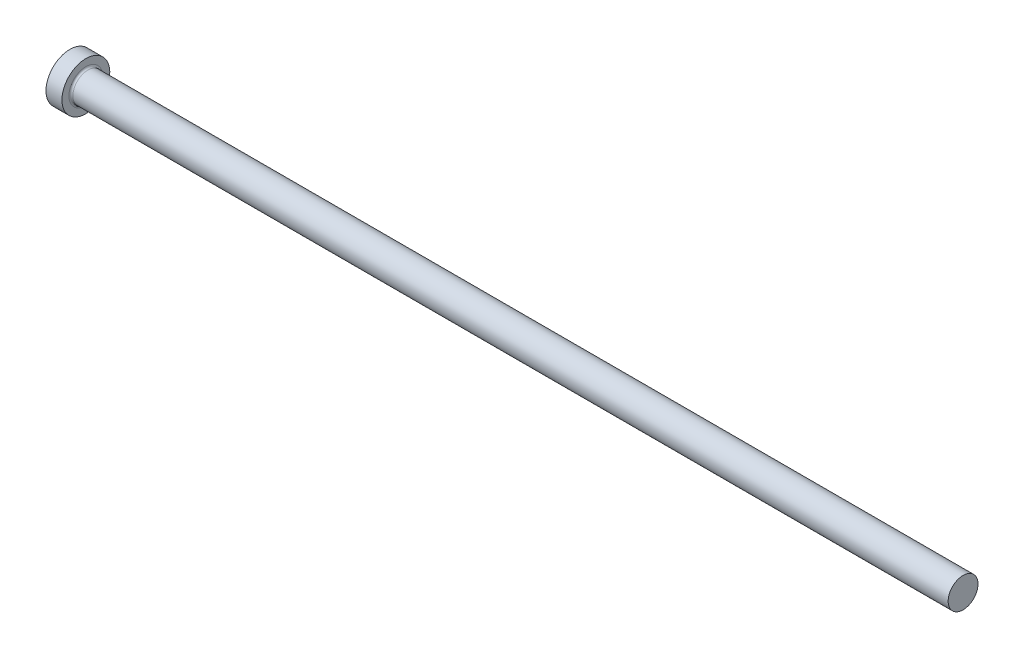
from build123d import *


with BuildPart() as part:
    # Sketch1 → PIN (revolve)
    with BuildSketch(Plane.XY, mode=Mode.PRIVATE) as pin_sk:
        with BuildLine():
            Line((0, 0), (0, 9.525))
            Line((0, 9.525), (6.35, 9.525))
            Line((6.35, 9.525), (6.35, 6.73481))
            ThreePointArc((6.35, 6.73481), (6.58062412, 6.17803412), (7.1374, 5.94741))
            Line((7.1374, 5.94741), (355.6, 5.94741))
            Line((355.6, 5.94741), (355.6, 0))
            Line((355.6, 0), (0, 0))
        make_face()
    revolve(pin_sk.sketch.rotate(Axis((355.6, 0, 0), (-1, 0, 0)), 180), axis=Axis((355.6, 0, 0), (-1, 0, 0)))


solid = part.part
